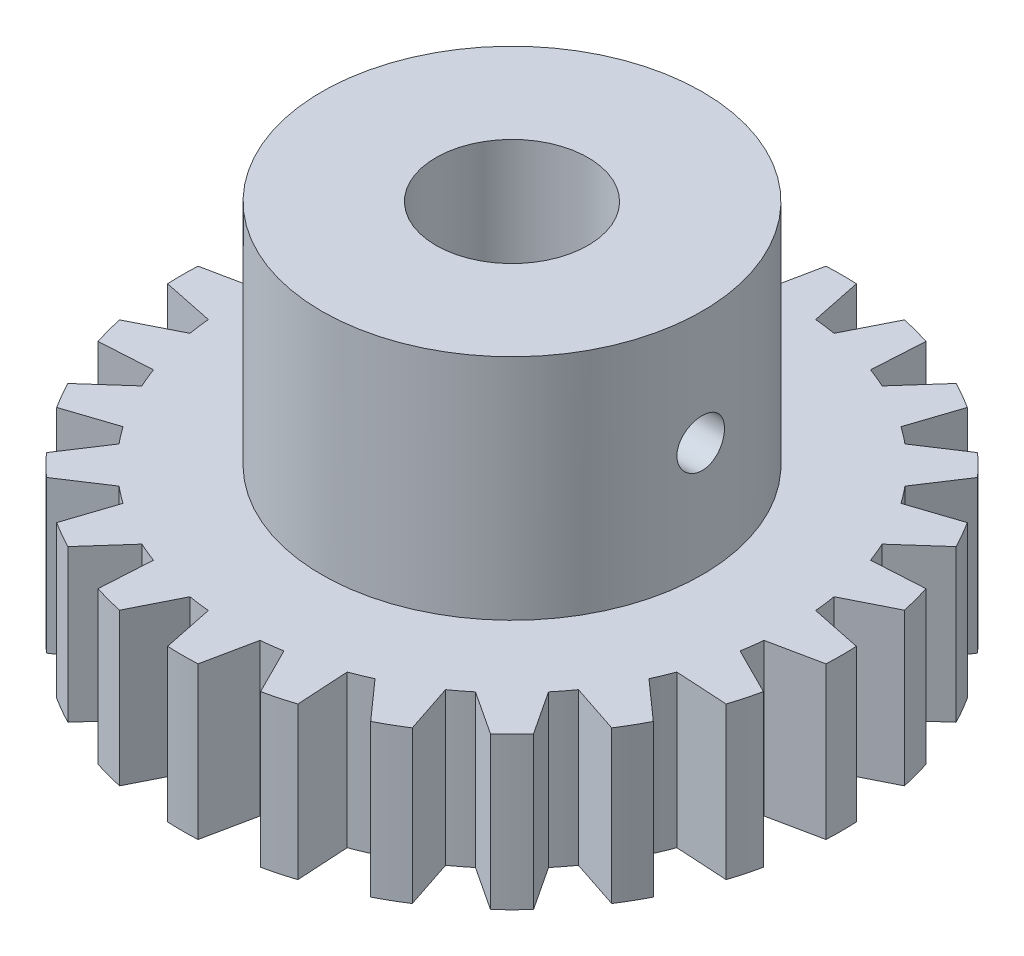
from build123d import *

# Parameters (mm, degrees)
SKETCH1_R               = 3.175
BOSS_EXTRUDE1_DEPTH     = 6.35
SKETCH2_R               = 7.9375
SKETCH2_R_2             = 3.175
BOSS_EXTRUDE2_DEPTH     = 9.525
CUT_EXTRUDE1_DEPTH      = 26.107093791
CUT_EXTRUDE1_DEPTH_BACK = 26.107093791
SKETCH3_R               = 0.9921875


with BuildPart() as part:
    # Sketch1 → Boss-Extrude1 (new body)
    with BuildSketch(Plane(origin=(0, 0, 0), x_dir=(1, 0, 0), z_dir=(0, 1, 0))):
        with BuildLine():
            Line((-0.635, 13.739433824), (-1.07812941, 11.595888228))
            ThreePointArc((-1.07812941, 11.595888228), (-1.520094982, 11.546267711), (-1.959843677, 11.479808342))
            Line((-1.959843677, 11.479808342), (-2.942664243, 13.435624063))
            ThreePointArc((-2.942664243, 13.435624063), (-3.559823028, 13.285440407), (-4.169390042, 13.106923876))
            Line((-4.169390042, 13.106923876), (-4.042629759, 10.921727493))
            ThreePointArc((-4.042629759, 10.921727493), (-4.456692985, 10.759408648), (-4.864256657, 10.581398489))
            Line((-4.864256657, 10.581398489), (-6.319790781, 12.216198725))
            ThreePointArc((-6.319790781, 12.216198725), (-6.87705, 11.911400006), (-7.419643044, 11.581198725))
            Line((-7.419643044, 11.581198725), (-6.731631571, 9.50326908))
            ThreePointArc((-6.731631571, 9.50326908), (-7.089574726, 9.239313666), (-7.437178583, 8.961883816))
            Line((-7.437178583, 8.961883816), (-9.266234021, 10.164259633))
            ThreePointArc((-9.266234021, 10.164259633), (-9.725617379, 9.725617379), (-10.164259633, 9.266234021))
            Line((-10.164259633, 9.266234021), (-8.961883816, 7.437178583))
            ThreePointArc((-8.961883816, 7.437178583), (-9.239313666, 7.089574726), (-9.50326908, 6.731631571))
            Line((-9.50326908, 6.731631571), (-11.581198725, 7.419643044))
            ThreePointArc((-11.581198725, 7.419643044), (-11.911400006, 6.87705), (-12.216198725, 6.319790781))
            Line((-12.216198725, 6.319790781), (-10.581398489, 4.864256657))
            ThreePointArc((-10.581398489, 4.864256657), (-10.759408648, 4.456692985), (-10.921727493, 4.042629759))
            Line((-10.921727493, 4.042629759), (-13.106923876, 4.169390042))
            ThreePointArc((-13.106923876, 4.169390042), (-13.285440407, 3.559823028), (-13.435624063, 2.942664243))
            Line((-13.435624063, 2.942664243), (-11.479808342, 1.959843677))
            ThreePointArc((-11.479808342, 1.959843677), (-11.546267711, 1.520094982), (-11.595888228, 1.07812941))
            Line((-11.595888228, 1.07812941), (-13.739433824, 0.635))
            ThreePointArc((-13.739433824, 0.635), (-13.7541, 0), (-13.739433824, -0.635))
            Line((-13.739433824, -0.635), (-11.595888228, -1.07812941))
            ThreePointArc((-11.595888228, -1.07812941), (-11.546267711, -1.520094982), (-11.479808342, -1.959843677))
            Line((-11.479808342, -1.959843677), (-13.435624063, -2.942664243))
            ThreePointArc((-13.435624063, -2.942664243), (-13.285440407, -3.559823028), (-13.106923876, -4.169390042))
            Line((-13.106923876, -4.169390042), (-10.921727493, -4.042629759))
            ThreePointArc((-10.921727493, -4.042629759), (-10.759408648, -4.456692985), (-10.581398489, -4.864256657))
            Line((-10.581398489, -4.864256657), (-12.216198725, -6.319790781))
            ThreePointArc((-12.216198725, -6.319790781), (-11.911400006, -6.87705), (-11.581198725, -7.419643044))
            Line((-11.581198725, -7.419643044), (-9.50326908, -6.731631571))
            ThreePointArc((-9.50326908, -6.731631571), (-9.239313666, -7.089574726), (-8.961883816, -7.437178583))
            Line((-8.961883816, -7.437178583), (-10.164259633, -9.266234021))
            ThreePointArc((-10.164259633, -9.266234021), (-9.725617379, -9.725617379), (-9.266234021, -10.164259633))
            Line((-9.266234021, -10.164259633), (-7.437178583, -8.961883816))
            ThreePointArc((-7.437178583, -8.961883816), (-7.089574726, -9.239313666), (-6.731631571, -9.50326908))
            Line((-6.731631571, -9.50326908), (-7.419643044, -11.581198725))
            ThreePointArc((-7.419643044, -11.581198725), (-6.87705, -11.911400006), (-6.319790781, -12.216198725))
            Line((-6.319790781, -12.216198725), (-4.864256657, -10.581398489))
            ThreePointArc((-4.864256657, -10.581398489), (-4.456692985, -10.759408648), (-4.042629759, -10.921727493))
            Line((-4.042629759, -10.921727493), (-4.169390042, -13.106923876))
            ThreePointArc((-4.169390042, -13.106923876), (-3.559823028, -13.285440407), (-2.942664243, -13.435624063))
            Line((-2.942664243, -13.435624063), (-1.959843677, -11.479808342))
            ThreePointArc((-1.959843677, -11.479808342), (-1.520094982, -11.546267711), (-1.07812941, -11.595888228))
            Line((-1.07812941, -11.595888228), (-0.635, -13.739433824))
            ThreePointArc((-0.635, -13.739433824), (0, -13.7541), (0.635, -13.739433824))
            Line((0.635, -13.739433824), (1.07812941, -11.595888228))
            ThreePointArc((1.07812941, -11.595888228), (1.520094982, -11.546267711), (1.959843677, -11.479808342))
            Line((1.959843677, -11.479808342), (2.942664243, -13.435624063))
            ThreePointArc((2.942664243, -13.435624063), (3.559823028, -13.285440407), (4.169390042, -13.106923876))
            Line((4.169390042, -13.106923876), (4.042629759, -10.921727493))
            ThreePointArc((4.042629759, -10.921727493), (4.456692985, -10.759408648), (4.864256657, -10.581398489))
            Line((4.864256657, -10.581398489), (6.319790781, -12.216198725))
            ThreePointArc((6.319790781, -12.216198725), (6.87705, -11.911400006), (7.419643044, -11.581198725))
            Line((7.419643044, -11.581198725), (6.731631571, -9.50326908))
            ThreePointArc((6.731631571, -9.50326908), (7.089574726, -9.239313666), (7.437178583, -8.961883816))
            Line((7.437178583, -8.961883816), (9.266234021, -10.164259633))
            ThreePointArc((9.266234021, -10.164259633), (9.725617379, -9.725617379), (10.164259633, -9.266234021))
            Line((10.164259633, -9.266234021), (8.961883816, -7.437178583))
            ThreePointArc((8.961883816, -7.437178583), (9.239313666, -7.089574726), (9.50326908, -6.731631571))
            Line((9.50326908, -6.731631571), (11.581198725, -7.419643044))
            ThreePointArc((11.581198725, -7.419643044), (11.911400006, -6.87705), (12.216198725, -6.319790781))
            Line((12.216198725, -6.319790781), (10.581398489, -4.864256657))
            ThreePointArc((10.581398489, -4.864256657), (10.759408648, -4.456692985), (10.921727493, -4.042629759))
            Line((10.921727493, -4.042629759), (13.106923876, -4.169390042))
            ThreePointArc((13.106923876, -4.169390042), (13.285440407, -3.559823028), (13.435624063, -2.942664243))
            Line((13.435624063, -2.942664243), (11.479808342, -1.959843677))
            ThreePointArc((11.479808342, -1.959843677), (11.546267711, -1.520094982), (11.595888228, -1.07812941))
            Line((11.595888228, -1.07812941), (13.739433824, -0.635))
            ThreePointArc((13.739433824, -0.635), (13.7541, 0), (13.739433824, 0.635))
            Line((13.739433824, 0.635), (11.595888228, 1.07812941))
            ThreePointArc((11.595888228, 1.07812941), (11.546267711, 1.520094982), (11.479808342, 1.959843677))
            Line((11.479808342, 1.959843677), (13.435624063, 2.942664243))
            ThreePointArc((13.435624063, 2.942664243), (13.285440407, 3.559823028), (13.106923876, 4.169390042))
            Line((13.106923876, 4.169390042), (10.921727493, 4.042629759))
            ThreePointArc((10.921727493, 4.042629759), (10.759408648, 4.456692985), (10.581398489, 4.864256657))
            Line((10.581398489, 4.864256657), (12.216198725, 6.319790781))
            ThreePointArc((12.216198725, 6.319790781), (11.911400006, 6.87705), (11.581198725, 7.419643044))
            Line((11.581198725, 7.419643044), (9.50326908, 6.731631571))
            ThreePointArc((9.50326908, 6.731631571), (9.239313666, 7.089574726), (8.961883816, 7.437178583))
            Line((8.961883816, 7.437178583), (10.164259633, 9.266234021))
            ThreePointArc((10.164259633, 9.266234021), (9.725617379, 9.725617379), (9.266234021, 10.164259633))
            Line((9.266234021, 10.164259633), (7.437178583, 8.961883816))
            ThreePointArc((7.437178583, 8.961883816), (7.089574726, 9.239313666), (6.731631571, 9.50326908))
            Line((6.731631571, 9.50326908), (7.419643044, 11.581198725))
            ThreePointArc((7.419643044, 11.581198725), (6.87705, 11.911400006), (6.319790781, 12.216198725))
            Line((6.319790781, 12.216198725), (4.864256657, 10.581398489))
            ThreePointArc((4.864256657, 10.581398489), (4.456692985, 10.759408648), (4.042629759, 10.921727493))
            Line((4.042629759, 10.921727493), (4.169390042, 13.106923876))
            ThreePointArc((4.169390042, 13.106923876), (3.559823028, 13.285440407), (2.942664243, 13.435624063))
            Line((2.942664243, 13.435624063), (1.959843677, 11.479808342))
            ThreePointArc((1.959843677, 11.479808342), (1.520094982, 11.546267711), (1.07812941, 11.595888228))
            Line((1.07812941, 11.595888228), (0.635, 13.739433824))
            ThreePointArc((0.635, 13.739433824), (0, 13.7541), (-0.635, 13.739433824))
        make_face()
        with Locations(Location((0, 0, 0), (0, 0, 270))):
            Circle(SKETCH1_R, mode=Mode.SUBTRACT)
    extrude(amount=BOSS_EXTRUDE1_DEPTH)

    # Sketch2 → Boss-Extrude2 (add)
    with BuildSketch(Plane(origin=(0, 6.35, 0), x_dir=(1, 0, 0), z_dir=(0, 1, 0))):
        with Locations(Location((0, 0, 0), (0, 0, 90))):
            Circle(SKETCH2_R)
        with Locations(Location((0, 0, 0), (0, 0, 270))):
            Circle(SKETCH2_R_2, mode=Mode.SUBTRACT)
    extrude(amount=BOSS_EXTRUDE2_DEPTH)

    # Sketch3 → Cut-Extrude1 (cut, two sides: drawn at the far end of the back side and taken through both)
    with BuildSketch(Plane(origin=(0, 0, 0), x_dir=(0, 0, -1), z_dir=(1, 0, 0)).offset(-CUT_EXTRUDE1_DEPTH_BACK)):
        with Locations((0, 11.1125)):
            Circle(SKETCH3_R)
    extrude(amount=CUT_EXTRUDE1_DEPTH + CUT_EXTRUDE1_DEPTH_BACK, mode=Mode.SUBTRACT)


solid = part.part
